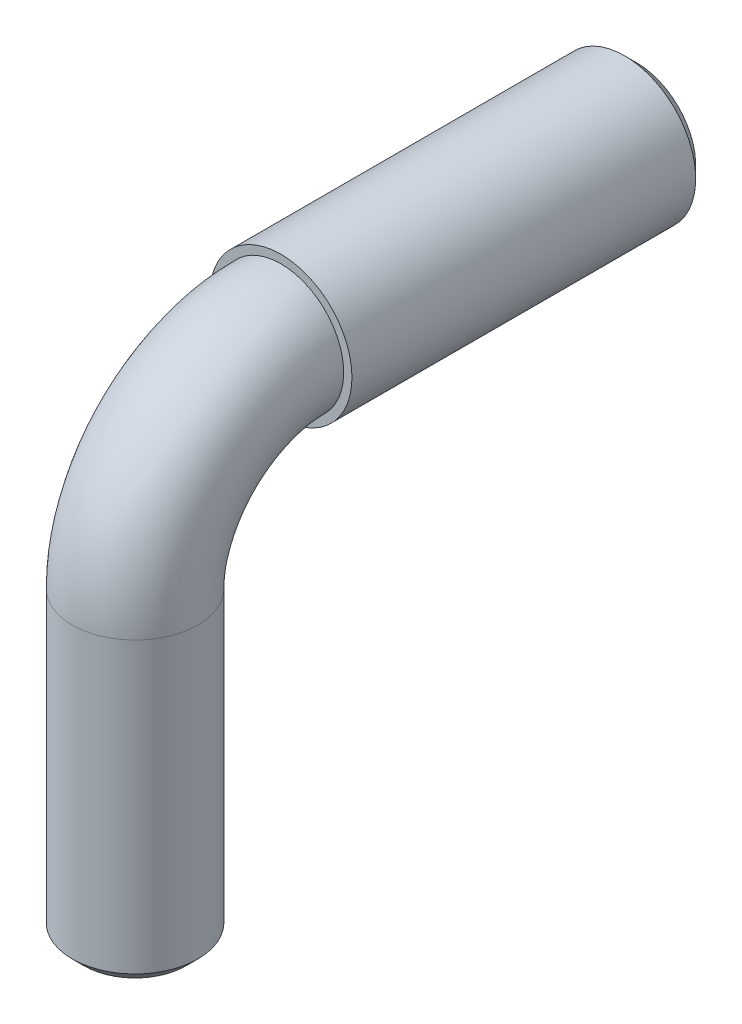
ISO-10303-21;
HEADER;
FILE_DESCRIPTION(('STEP AP214'),'2;1');
FILE_NAME('part.step','',(''),(''),'','','');
FILE_SCHEMA(('AUTOMOTIVE_DESIGN { 1 0 10303 214 1 1 1 1 }'));
ENDSEC;
DATA;
#1=APPLICATION_CONTEXT('core data for automotive mechanical design processes');
#2=APPLICATION_PROTOCOL_DEFINITION('international standard','automotive_design',2000,#1);
#3=PRODUCT_CONTEXT('',#1,'mechanical');
#4=PRODUCT('Part','Part','',(#3));
#5=PRODUCT_RELATED_PRODUCT_CATEGORY('part','',(#4));
#6=PRODUCT_DEFINITION_FORMATION('','',#4);
#7=PRODUCT_DEFINITION_CONTEXT('part definition',#1,'design');
#8=PRODUCT_DEFINITION('design','',#6,#7);
#9=PRODUCT_DEFINITION_SHAPE('','',#8);
#10=(LENGTH_UNIT() NAMED_UNIT(*) SI_UNIT(.MILLI.,.METRE.));
#11=(NAMED_UNIT(*) PLANE_ANGLE_UNIT() SI_UNIT($,.RADIAN.));
#12=(NAMED_UNIT(*) SI_UNIT($,.STERADIAN.) SOLID_ANGLE_UNIT());
#13=UNCERTAINTY_MEASURE_WITH_UNIT(LENGTH_MEASURE(1.E-05),#10,'distance_accuracy_value','');
#14=(GEOMETRIC_REPRESENTATION_CONTEXT(3) GLOBAL_UNCERTAINTY_ASSIGNED_CONTEXT((#13)) GLOBAL_UNIT_ASSIGNED_CONTEXT((#10,
#11,#12)) REPRESENTATION_CONTEXT('',''));
#15=CARTESIAN_POINT('',(0.,0.,0.));
#16=DIRECTION('',(0.,0.,1.));
#17=DIRECTION('',(1.,0.,0.));
#18=AXIS2_PLACEMENT_3D('',#15,#16,#17);
#19=CARTESIAN_POINT('',(0.,0.,15.));
#20=DIRECTION('',(0.,0.,-1.));
#21=DIRECTION('',(-1.,0.,0.));
#22=AXIS2_PLACEMENT_3D('',#19,#20,#21);
#23=CYLINDRICAL_SURFACE('',#22,3.);
#24=CARTESIAN_POINT('',(0.,0.,0.5));
#25=DIRECTION('',(0.,0.,-1.));
#26=DIRECTION('',(-1.,0.,0.));
#27=AXIS2_PLACEMENT_3D('',#24,#25,#26);
#28=CIRCLE('',#27,3.);
#29=CARTESIAN_POINT('',(-3.,0.,0.5));
#30=VERTEX_POINT('',#29);
#31=EDGE_CURVE('E25',#30,#30,#28,.F.);
#32=ORIENTED_EDGE('',*,*,#31,.T.);
#33=EDGE_LOOP('',(#32));
#34=FACE_BOUND('',#33,.T.);
#35=CARTESIAN_POINT('',(0.,0.,15.));
#36=DIRECTION('',(0.,0.,-1.));
#37=DIRECTION('',(1.,0.,0.));
#38=AXIS2_PLACEMENT_3D('',#35,#36,#37);
#39=CIRCLE('',#38,3.);
#40=CARTESIAN_POINT('',(3.,0.,15.));
#41=VERTEX_POINT('',#40);
#42=EDGE_CURVE('E34',#41,#41,#39,.T.);
#43=ORIENTED_EDGE('',*,*,#42,.T.);
#44=EDGE_LOOP('',(#43));
#45=FACE_BOUND('',#44,.T.);
#46=ADVANCED_FACE('F15',(#34,#45),#23,.T.);
#47=CARTESIAN_POINT('',(0.,0.,15.));
#48=DIRECTION('',(0.,0.,-1.));
#49=DIRECTION('',(-1.,0.,0.));
#50=AXIS2_PLACEMENT_3D('',#47,#48,#49);
#51=PLANE('',#50);
#52=CARTESIAN_POINT('',(0.,0.,15.));
#53=DIRECTION('',(0.,0.,-1.));
#54=DIRECTION('',(1.,0.,0.));
#55=AXIS2_PLACEMENT_3D('',#52,#53,#54);
#56=CIRCLE('',#55,2.65);
#57=CARTESIAN_POINT('',(0.,2.65,15.));
#58=VERTEX_POINT('',#57);
#59=EDGE_CURVE('E37',#58,#58,#56,.T.);
#60=ORIENTED_EDGE('',*,*,#59,.T.);
#61=EDGE_LOOP('',(#60));
#62=FACE_BOUND('',#61,.T.);
#63=ORIENTED_EDGE('',*,*,#42,.F.);
#64=EDGE_LOOP('',(#63));
#65=FACE_BOUND('',#64,.T.);
#66=ADVANCED_FACE('F65',(#62,#65),#51,.F.);
#67=CARTESIAN_POINT('',(0.,0.,0.));
#68=DIRECTION('',(0.,0.,-1.));
#69=DIRECTION('',(-1.,0.,0.));
#70=AXIS2_PLACEMENT_3D('',#67,#68,#69);
#71=PLANE('',#70);
#72=CARTESIAN_POINT('',(0.,0.,0.));
#73=DIRECTION('',(0.,0.,-1.));
#74=DIRECTION('',(-1.,0.,0.));
#75=AXIS2_PLACEMENT_3D('',#72,#73,#74);
#76=CIRCLE('',#75,2.5);
#77=CARTESIAN_POINT('',(-2.5,0.,0.));
#78=VERTEX_POINT('',#77);
#79=EDGE_CURVE('E29',#78,#78,#76,.T.);
#80=ORIENTED_EDGE('',*,*,#79,.T.);
#81=EDGE_LOOP('',(#80));
#82=FACE_BOUND('',#81,.T.);
#83=ADVANCED_FACE('F62',(#82),#71,.T.);
#84=CARTESIAN_POINT('',(0.,-6.15000000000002,15.));
#85=DIRECTION('',(-1.,0.,0.));
#86=DIRECTION('',(0.,0.,1.));
#87=AXIS2_PLACEMENT_3D('',#84,#85,#86);
#88=TOROIDAL_SURFACE('',#87,6.15000000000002,2.65);
#89=CARTESIAN_POINT('',(0.,-6.15000000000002,21.15));
#90=DIRECTION('',(0.,1.,0.));
#91=DIRECTION('',(1.,0.,0.));
#92=AXIS2_PLACEMENT_3D('',#89,#90,#91);
#93=CIRCLE('',#92,2.65);
#94=CARTESIAN_POINT('',(0.,-6.15000000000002,23.8));
#95=VERTEX_POINT('',#94);
#96=EDGE_CURVE('E41',#95,#95,#93,.T.);
#97=CARTESIAN_POINT('',(0.,-6.15000000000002,15.));
#98=DIRECTION('',(-1.,0.,0.));
#99=DIRECTION('',(0.,0.,1.));
#100=AXIS2_PLACEMENT_3D('',#97,#98,#99);
#101=CIRCLE('',#100,8.80000000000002);
#102=EDGE_CURVE('',#95,#58,#101,.T.);
#103=ORIENTED_EDGE('',*,*,#96,.T.);
#104=ORIENTED_EDGE('',*,*,#59,.F.);
#105=ORIENTED_EDGE('',*,*,#102,.T.);
#106=ORIENTED_EDGE('',*,*,#102,.F.);
#107=EDGE_LOOP('',(#103,#105,#104,#106));
#108=FACE_BOUND('',#107,.T.);
#109=ADVANCED_FACE('F48',(#108),#88,.T.);
#110=CARTESIAN_POINT('',(0.,-18.85,21.15));
#111=DIRECTION('',(0.,1.,0.));
#112=DIRECTION('',(0.,0.,1.));
#113=AXIS2_PLACEMENT_3D('',#110,#111,#112);
#114=CYLINDRICAL_SURFACE('',#113,2.65);
#115=CARTESIAN_POINT('',(0.,-18.35,21.15));
#116=DIRECTION('',(0.,1.,0.));
#117=DIRECTION('',(0.,0.,1.));
#118=AXIS2_PLACEMENT_3D('',#115,#116,#117);
#119=CIRCLE('',#118,2.65);
#120=CARTESIAN_POINT('',(0.,-18.35,23.8));
#121=VERTEX_POINT('',#120);
#122=EDGE_CURVE('E21',#121,#121,#119,.T.);
#123=ORIENTED_EDGE('',*,*,#122,.T.);
#124=EDGE_LOOP('',(#123));
#125=FACE_BOUND('',#124,.T.);
#126=ORIENTED_EDGE('',*,*,#96,.F.);
#127=EDGE_LOOP('',(#126));
#128=FACE_BOUND('',#127,.T.);
#129=ADVANCED_FACE('F51',(#125,#128),#114,.T.);
#130=CARTESIAN_POINT('',(0.,-18.85,21.15));
#131=DIRECTION('',(0.,1.,0.));
#132=DIRECTION('',(0.,0.,1.));
#133=AXIS2_PLACEMENT_3D('',#130,#131,#132);
#134=PLANE('',#133);
#135=CARTESIAN_POINT('',(0.,-18.85,21.15));
#136=DIRECTION('',(0.,1.,0.));
#137=DIRECTION('',(0.,0.,1.));
#138=AXIS2_PLACEMENT_3D('',#135,#136,#137);
#139=CIRCLE('',#138,2.15);
#140=CARTESIAN_POINT('',(0.,-18.85,23.3));
#141=VERTEX_POINT('',#140);
#142=EDGE_CURVE('E10',#141,#141,#139,.F.);
#143=ORIENTED_EDGE('',*,*,#142,.T.);
#144=EDGE_LOOP('',(#143));
#145=FACE_BOUND('',#144,.T.);
#146=ADVANCED_FACE('F53',(#145),#134,.F.);
#147=CARTESIAN_POINT('',(0.,0.,0.));
#148=DIRECTION('',(0.,0.,1.));
#149=DIRECTION('',(1.,0.,0.));
#150=AXIS2_PLACEMENT_3D('',#147,#148,#149);
#151=CONICAL_SURFACE('',#150,2.5,0.785398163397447);
#152=ORIENTED_EDGE('',*,*,#31,.F.);
#153=EDGE_LOOP('',(#152));
#154=FACE_BOUND('',#153,.T.);
#155=ORIENTED_EDGE('',*,*,#79,.F.);
#156=EDGE_LOOP('',(#155));
#157=FACE_BOUND('',#156,.T.);
#158=ADVANCED_FACE('F60',(#154,#157),#151,.T.);
#159=CARTESIAN_POINT('',(0.,-18.35,21.15));
#160=DIRECTION('',(0.,1.,0.));
#161=DIRECTION('',(0.,0.,1.));
#162=AXIS2_PLACEMENT_3D('',#159,#160,#161);
#163=CONICAL_SURFACE('',#162,2.65,0.785398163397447);
#164=ORIENTED_EDGE('',*,*,#142,.F.);
#165=EDGE_LOOP('',(#164));
#166=FACE_BOUND('',#165,.T.);
#167=ORIENTED_EDGE('',*,*,#122,.F.);
#168=EDGE_LOOP('',(#167));
#169=FACE_BOUND('',#168,.T.);
#170=ADVANCED_FACE('F78',(#166,#169),#163,.T.);
#171=CLOSED_SHELL('',(#46,#66,#83,#109,#129,#146,#158,#170));
#172=MANIFOLD_SOLID_BREP('B1',#171);
#173=ADVANCED_BREP_SHAPE_REPRESENTATION('',(#18,#172),#14);
#174=SHAPE_DEFINITION_REPRESENTATION(#9,#173);
ENDSEC;
END-ISO-10303-21;
